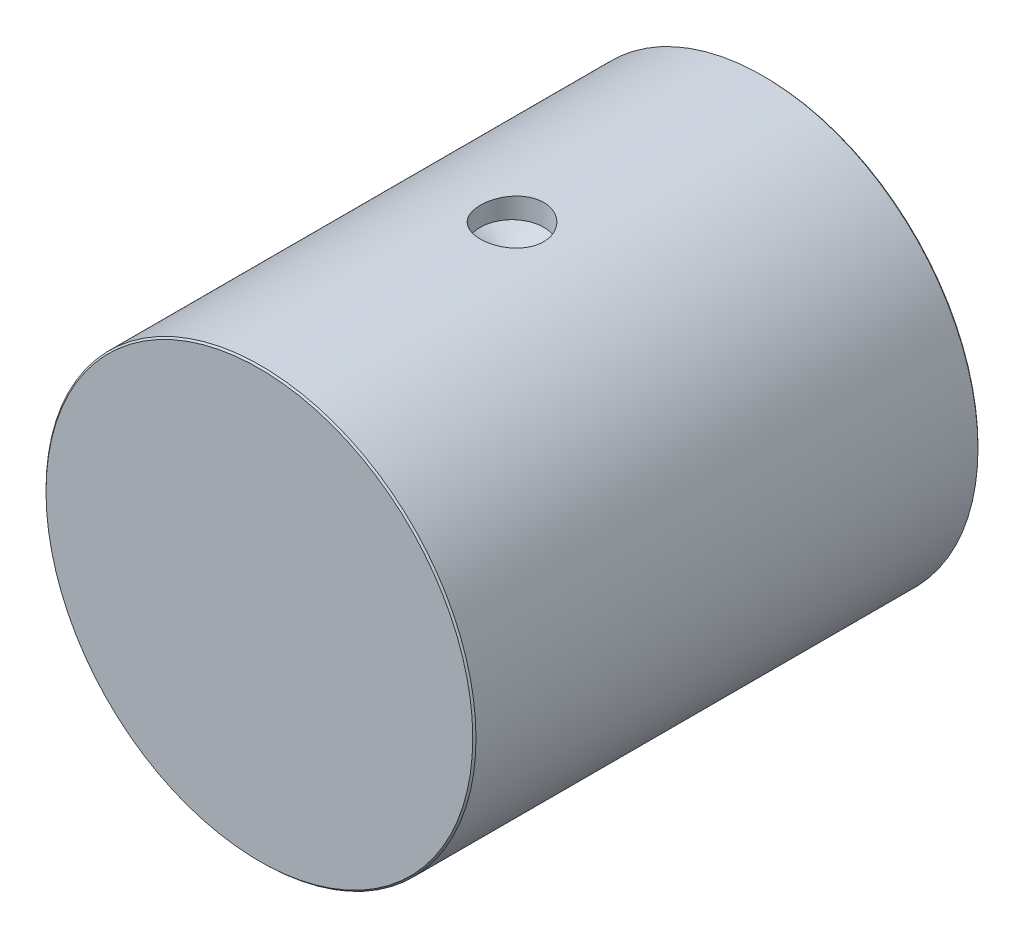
ISO-10303-21;
HEADER;
FILE_DESCRIPTION(('STEP AP214'),'2;1');
FILE_NAME('part.step','',(''),(''),'','','');
FILE_SCHEMA(('AUTOMOTIVE_DESIGN { 1 0 10303 214 1 1 1 1 }'));
ENDSEC;
DATA;
#1=APPLICATION_CONTEXT('core data for automotive mechanical design processes');
#2=APPLICATION_PROTOCOL_DEFINITION('international standard','automotive_design',2000,#1);
#3=PRODUCT_CONTEXT('',#1,'mechanical');
#4=PRODUCT('Part','Part','',(#3));
#5=PRODUCT_RELATED_PRODUCT_CATEGORY('part','',(#4));
#6=PRODUCT_DEFINITION_FORMATION('','',#4);
#7=PRODUCT_DEFINITION_CONTEXT('part definition',#1,'design');
#8=PRODUCT_DEFINITION('design','',#6,#7);
#9=PRODUCT_DEFINITION_SHAPE('','',#8);
#10=(LENGTH_UNIT() NAMED_UNIT(*) SI_UNIT(.MILLI.,.METRE.));
#11=(NAMED_UNIT(*) PLANE_ANGLE_UNIT() SI_UNIT($,.RADIAN.));
#12=(NAMED_UNIT(*) SI_UNIT($,.STERADIAN.) SOLID_ANGLE_UNIT());
#13=UNCERTAINTY_MEASURE_WITH_UNIT(LENGTH_MEASURE(1.E-05),#10,'distance_accuracy_value','');
#14=(GEOMETRIC_REPRESENTATION_CONTEXT(3) GLOBAL_UNCERTAINTY_ASSIGNED_CONTEXT((#13)) GLOBAL_UNIT_ASSIGNED_CONTEXT((#10,
#11,#12)) REPRESENTATION_CONTEXT('',''));
#15=CARTESIAN_POINT('',(0.,0.,0.));
#16=DIRECTION('',(0.,0.,1.));
#17=DIRECTION('',(1.,0.,0.));
#18=AXIS2_PLACEMENT_3D('',#15,#16,#17);
#19=CARTESIAN_POINT('',(0.,0.,-23.5));
#20=DIRECTION('',(0.,0.,1.));
#21=DIRECTION('',(1.,0.,0.));
#22=AXIS2_PLACEMENT_3D('',#19,#20,#21);
#23=CYLINDRICAL_SURFACE('',#22,20.);
#24=CARTESIAN_POINT('',(0.,20.,-2.95));
#25=CARTESIAN_POINT('',(-0.164743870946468,19.999997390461,-2.94999318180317));
#26=CARTESIAN_POINT('',(-0.329584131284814,19.9979431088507,-2.93615314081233));
#27=CARTESIAN_POINT('',(-0.654659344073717,19.9899458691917,-2.88117140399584));
#28=CARTESIAN_POINT('',(-0.814889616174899,19.9839990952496,-2.84000291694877));
#29=CARTESIAN_POINT('',(-1.12599314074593,19.9688853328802,-2.73161930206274));
#30=CARTESIAN_POINT('',(-1.2768732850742,19.9597207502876,-2.66442362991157));
#31=CARTESIAN_POINT('',(-1.56519264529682,19.9391847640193,-2.50594011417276));
#32=CARTESIAN_POINT('',(-1.70263377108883,19.9278136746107,-2.41465570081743));
#33=CARTESIAN_POINT('',(-1.96123689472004,19.9040335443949,-2.20984999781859));
#34=CARTESIAN_POINT('',(-2.08228251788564,19.8916180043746,-2.09618250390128));
#35=CARTESIAN_POINT('',(-2.3036547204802,19.8671993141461,-1.85015181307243));
#36=CARTESIAN_POINT('',(-2.40398012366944,19.8551961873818,-1.71778755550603));
#37=CARTESIAN_POINT('',(-2.58151504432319,19.8328982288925,-1.4373413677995));
#38=CARTESIAN_POINT('',(-2.65861233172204,19.8226117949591,-1.28918766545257));
#39=CARTESIAN_POINT('',(-2.786785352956,19.8050003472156,-0.981857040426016));
#40=CARTESIAN_POINT('',(-2.83786245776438,19.7976751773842,-0.822680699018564));
#41=CARTESIAN_POINT('',(-2.91218459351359,19.7868793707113,-0.499045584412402));
#42=CARTESIAN_POINT('',(-2.93562859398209,19.7833811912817,-0.334633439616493));
#43=CARTESIAN_POINT('',(-2.95463534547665,19.7805517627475,-0.00417435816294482));
#44=CARTESIAN_POINT('',(-2.95019964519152,19.7812202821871,0.161872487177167));
#45=CARTESIAN_POINT('',(-2.91373558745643,19.7866235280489,0.489484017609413));
#46=CARTESIAN_POINT('',(-2.88192856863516,19.7913256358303,0.651073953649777));
#47=CARTESIAN_POINT('',(-2.79197111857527,19.8042153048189,0.966597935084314));
#48=CARTESIAN_POINT('',(-2.73381996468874,19.8124029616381,1.12053177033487));
#49=CARTESIAN_POINT('',(-2.59259390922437,19.8313773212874,1.41704889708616));
#50=CARTESIAN_POINT('',(-2.50942499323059,19.8421737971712,1.55958676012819));
#51=CARTESIAN_POINT('',(-2.3205912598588,19.8651421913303,1.82876726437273));
#52=CARTESIAN_POINT('',(-2.21492501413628,19.8773141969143,1.95540889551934));
#53=CARTESIAN_POINT('',(-1.9828798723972,19.9018063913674,2.19048505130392));
#54=CARTESIAN_POINT('',(-1.85631062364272,19.9141268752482,2.2987317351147));
#55=CARTESIAN_POINT('',(-1.58670179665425,19.9374184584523,2.49247536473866));
#56=CARTESIAN_POINT('',(-1.443662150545,19.9483895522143,2.57797221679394));
#57=CARTESIAN_POINT('',(-1.14501201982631,19.9677571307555,2.72379786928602));
#58=CARTESIAN_POINT('',(-0.989394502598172,19.9761521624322,2.78411247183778));
#59=CARTESIAN_POINT('',(-0.670088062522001,19.9894094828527,2.87769974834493));
#60=CARTESIAN_POINT('',(-0.506399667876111,19.9942720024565,2.91097418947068));
#61=CARTESIAN_POINT('',(-0.177219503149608,19.9998859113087,2.94928750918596));
#62=CARTESIAN_POINT('',(-0.0117584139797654,20.0006749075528,2.95458468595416));
#63=CARTESIAN_POINT('',(0.317689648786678,19.9981551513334,2.93747828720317));
#64=CARTESIAN_POINT('',(0.481676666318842,19.9948465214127,2.91507554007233));
#65=CARTESIAN_POINT('',(0.802741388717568,19.9845265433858,2.84341999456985));
#66=CARTESIAN_POINT('',(0.959847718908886,19.9775325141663,2.79429274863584));
#67=CARTESIAN_POINT('',(1.26359350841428,19.9606235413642,2.67071494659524));
#68=CARTESIAN_POINT('',(1.41023248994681,19.9507084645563,2.59626323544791));
#69=CARTESIAN_POINT('',(1.69001876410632,19.9289661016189,2.42354189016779));
#70=CARTESIAN_POINT('',(1.82306366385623,19.9171258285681,2.32510805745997));
#71=CARTESIAN_POINT('',(2.07083767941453,19.8928921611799,2.10744564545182));
#72=CARTESIAN_POINT('',(2.18556576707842,19.8804987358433,1.98821589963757));
#73=CARTESIAN_POINT('',(2.39438679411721,19.856436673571,1.73119752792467));
#74=CARTESIAN_POINT('',(2.4883067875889,19.8447746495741,1.59326767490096));
#75=CARTESIAN_POINT('',(2.65164425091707,19.8236120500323,1.30343792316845));
#76=CARTESIAN_POINT('',(2.72106236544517,19.814111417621,1.15153839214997));
#77=CARTESIAN_POINT('',(2.83315620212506,19.7983948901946,0.838601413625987));
#78=CARTESIAN_POINT('',(2.87592363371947,19.7921677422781,0.677597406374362));
#79=CARTESIAN_POINT('',(2.9337943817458,19.7836730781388,0.350593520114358));
#80=CARTESIAN_POINT('',(2.94889954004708,19.7814052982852,0.184593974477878));
#81=CARTESIAN_POINT('',(2.95097422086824,19.7810957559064,-0.145965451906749));
#82=CARTESIAN_POINT('',(2.93821564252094,19.7830131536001,-0.310523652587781));
#83=CARTESIAN_POINT('',(2.88550694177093,19.7907692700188,-0.63512705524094));
#84=CARTESIAN_POINT('',(2.84555685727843,19.7966079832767,-0.795172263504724));
#85=CARTESIAN_POINT('',(2.73969416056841,19.811534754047,-1.10613546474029));
#86=CARTESIAN_POINT('',(2.67379992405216,19.8206205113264,-1.25705983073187));
#87=CARTESIAN_POINT('',(2.51794640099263,19.8410205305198,-1.54575484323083));
#88=CARTESIAN_POINT('',(2.42798635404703,19.8523348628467,-1.68352507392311));
#89=CARTESIAN_POINT('',(2.22556464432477,19.876048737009,-1.94338344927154));
#90=CARTESIAN_POINT('',(2.11290144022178,19.8884573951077,-2.06531378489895));
#91=CARTESIAN_POINT('',(1.86869726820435,19.9128851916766,-2.28863519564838));
#92=CARTESIAN_POINT('',(1.73715191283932,19.924904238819,-2.39002148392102));
#93=CARTESIAN_POINT('',(1.4580969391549,19.9472713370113,-2.56985609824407));
#94=CARTESIAN_POINT('',(1.31050621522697,19.9576101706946,-2.64817969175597));
#95=CARTESIAN_POINT('',(1.00418307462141,19.9753613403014,-2.77880967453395));
#96=CARTESIAN_POINT('',(0.845462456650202,19.9827767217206,-2.83114315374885));
#97=CARTESIAN_POINT('',(0.571681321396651,19.9921424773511,-2.89636367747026));
#98=CARTESIAN_POINT('',(0.458315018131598,19.9950740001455,-2.91644676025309));
#99=CARTESIAN_POINT('',(0.229981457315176,19.9990036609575,-2.94326722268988));
#100=CARTESIAN_POINT('',(0.115014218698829,20.0000018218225,-2.95000476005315));
#101=CARTESIAN_POINT('',(0.,20.,-2.95));
#102=B_SPLINE_CURVE_WITH_KNOTS('',3,(#24,#25,#26,#27,#28,#29,#30,#31,#32,#33,#34,#35,#36,#37,
#38,#39,#40,#41,#42,#43,#44,#45,#46,#47,#48,#49,#50,#51,#52,#53,#54,#55,#56,#57,#58,#59,#60,#61,
#62,#63,#64,#65,#66,#67,#68,#69,#70,#71,#72,#73,#74,#75,#76,#77,#78,#79,#80,#81,#82,#83,#84,#85,
#86,#87,#88,#89,#90,#91,#92,#93,#94,#95,#96,#97,#98,#99,#100,#101),.UNSPECIFIED.,.T.,.F.,(4,2,2,
2,2,2,2,2,2,2,2,2,2,2,2,2,2,2,2,2,2,2,2,2,2,2,2,2,2,2,2,2,2,2,2,2,2,2,4),(0.,0.493811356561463,
0.988107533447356,1.4820349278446,1.975892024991,2.47308887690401,2.97031394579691,
3.46990426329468,3.96946825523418,4.4654127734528,4.96132974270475,5.45327375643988,
5.94523126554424,6.43906110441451,6.93292230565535,7.4315576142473,7.93019497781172,
8.42911309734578,8.92799860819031,9.42227003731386,9.91652668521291,10.4084811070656,
10.9004579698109,11.3959028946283,11.8913756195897,12.3908236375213,12.8902585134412,
13.3879651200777,13.8856385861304,14.3784773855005,14.87131549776,15.3638051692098,
15.8563104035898,16.353397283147,16.8505998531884,17.3504440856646,17.849766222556,
18.1945195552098,18.5392688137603),.UNSPECIFIED.);
#103=CARTESIAN_POINT('',(0.,20.,-2.95));
#104=VERTEX_POINT('',#103);
#105=EDGE_CURVE('E11',#104,#104,#102,.T.);
#106=ORIENTED_EDGE('',*,*,#105,.F.);
#107=EDGE_LOOP('',(#106));
#108=FACE_BOUND('',#107,.T.);
#109=CARTESIAN_POINT('',(0.,0.,23.35));
#110=DIRECTION('',(0.,0.,1.));
#111=DIRECTION('',(1.,0.,0.));
#112=AXIS2_PLACEMENT_3D('',#109,#110,#111);
#113=CIRCLE('',#112,20.);
#114=CARTESIAN_POINT('',(20.,0.,23.35));
#115=VERTEX_POINT('',#114);
#116=EDGE_CURVE('E385',#115,#115,#113,.F.);
#117=ORIENTED_EDGE('',*,*,#116,.T.);
#118=EDGE_LOOP('',(#117));
#119=FACE_BOUND('',#118,.T.);
#120=CARTESIAN_POINT('',(0.,0.,-23.35));
#121=DIRECTION('',(0.,0.,1.));
#122=DIRECTION('',(1.,0.,0.));
#123=AXIS2_PLACEMENT_3D('',#120,#121,#122);
#124=CIRCLE('',#123,20.);
#125=CARTESIAN_POINT('',(20.,0.,-23.35));
#126=VERTEX_POINT('',#125);
#127=EDGE_CURVE('E388',#126,#126,#124,.T.);
#128=ORIENTED_EDGE('',*,*,#127,.T.);
#129=EDGE_LOOP('',(#128));
#130=FACE_BOUND('',#129,.T.);
#131=ADVANCED_FACE('F348',(#108,#119,#130),#23,.T.);
#132=CARTESIAN_POINT('',(0.,0.,-23.5));
#133=DIRECTION('',(0.,0.,1.));
#134=DIRECTION('',(1.,0.,0.));
#135=AXIS2_PLACEMENT_3D('',#132,#133,#134);
#136=PLANE('',#135);
#137=CARTESIAN_POINT('',(0.,0.,-23.5));
#138=DIRECTION('',(0.,0.,1.));
#139=DIRECTION('',(1.,0.,0.));
#140=AXIS2_PLACEMENT_3D('',#137,#138,#139);
#141=CIRCLE('',#140,19.85);
#142=CARTESIAN_POINT('',(19.85,0.,-23.5));
#143=VERTEX_POINT('',#142);
#144=EDGE_CURVE('E358',#143,#143,#141,.F.);
#145=ORIENTED_EDGE('',*,*,#144,.T.);
#146=EDGE_LOOP('',(#145));
#147=FACE_BOUND('',#146,.T.);
#148=ADVANCED_FACE('F373',(#147),#136,.F.);
#149=CARTESIAN_POINT('',(0.,0.,23.5));
#150=DIRECTION('',(0.,0.,1.));
#151=DIRECTION('',(1.,0.,0.));
#152=AXIS2_PLACEMENT_3D('',#149,#150,#151);
#153=PLANE('',#152);
#154=CARTESIAN_POINT('',(0.,0.,23.5));
#155=DIRECTION('',(0.,0.,1.));
#156=DIRECTION('',(1.,0.,0.));
#157=AXIS2_PLACEMENT_3D('',#154,#155,#156);
#158=CIRCLE('',#157,19.85);
#159=CARTESIAN_POINT('',(19.85,0.,23.5));
#160=VERTEX_POINT('',#159);
#161=EDGE_CURVE('E390',#160,#160,#158,.T.);
#162=ORIENTED_EDGE('',*,*,#161,.T.);
#163=EDGE_LOOP('',(#162));
#164=FACE_BOUND('',#163,.T.);
#165=ADVANCED_FACE('F378',(#164),#153,.T.);
#166=CARTESIAN_POINT('',(0.,0.,23.5));
#167=DIRECTION('',(0.,0.,-1.));
#168=DIRECTION('',(-1.,0.,0.));
#169=AXIS2_PLACEMENT_3D('',#166,#167,#168);
#170=CONICAL_SURFACE('',#169,19.85,0.78539816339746);
#171=ORIENTED_EDGE('',*,*,#116,.F.);
#172=EDGE_LOOP('',(#171));
#173=FACE_BOUND('',#172,.T.);
#174=ORIENTED_EDGE('',*,*,#161,.F.);
#175=EDGE_LOOP('',(#174));
#176=FACE_BOUND('',#175,.T.);
#177=ADVANCED_FACE('F401',(#173,#176),#170,.T.);
#178=CARTESIAN_POINT('',(0.,0.,-23.35));
#179=DIRECTION('',(0.,0.,1.));
#180=DIRECTION('',(1.,0.,0.));
#181=AXIS2_PLACEMENT_3D('',#178,#179,#180);
#182=CONICAL_SURFACE('',#181,20.,0.785398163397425);
#183=ORIENTED_EDGE('',*,*,#144,.F.);
#184=EDGE_LOOP('',(#183));
#185=FACE_BOUND('',#184,.T.);
#186=ORIENTED_EDGE('',*,*,#127,.F.);
#187=EDGE_LOOP('',(#186));
#188=FACE_BOUND('',#187,.T.);
#189=ADVANCED_FACE('F369',(#185,#188),#182,.T.);
#190=CARTESIAN_POINT('',(0.,-1.79056183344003,0.));
#191=DIRECTION('',(0.,-1.,0.));
#192=DIRECTION('',(0.,0.,-1.));
#193=AXIS2_PLACEMENT_3D('',#190,#191,#192);
#194=CYLINDRICAL_SURFACE('',#193,2.95);
#195=ORIENTED_EDGE('',*,*,#105,.T.);
#196=EDGE_LOOP('',(#195));
#197=FACE_BOUND('',#196,.T.);
#198=CARTESIAN_POINT('',(0.,18.,0.));
#199=DIRECTION('',(0.,-1.,0.));
#200=DIRECTION('',(0.,0.,-1.));
#201=AXIS2_PLACEMENT_3D('',#198,#199,#200);
#202=CIRCLE('',#201,2.95);
#203=CARTESIAN_POINT('',(0.,18.,-2.95));
#204=VERTEX_POINT('',#203);
#205=EDGE_CURVE('E394',#204,#204,#202,.T.);
#206=ORIENTED_EDGE('',*,*,#205,.T.);
#207=EDGE_LOOP('',(#206));
#208=FACE_BOUND('',#207,.T.);
#209=ADVANCED_FACE('F363',(#197,#208),#194,.F.);
#210=CARTESIAN_POINT('',(0.,16.2968167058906,0.));
#211=DIRECTION('',(0.,1.,0.));
#212=DIRECTION('',(0.,0.,1.));
#213=AXIS2_PLACEMENT_3D('',#210,#211,#212);
#214=CONICAL_SURFACE('',#213,0.,1.04719755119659);
#215=ORIENTED_EDGE('',*,*,#205,.F.);
#216=EDGE_LOOP('',(#215));
#217=FACE_BOUND('',#216,.T.);
#218=CARTESIAN_POINT('',(0.,16.2968167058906,0.));
#219=VERTEX_POINT('',#218);
#220=VERTEX_LOOP('',#219);
#221=FACE_BOUND('',#220,.T.);
#222=ADVANCED_FACE('F361',(#217,#221),#214,.F.);
#223=CLOSED_SHELL('',(#131,#148,#165,#177,#189,#209,#222));
#224=MANIFOLD_SOLID_BREP('B2',#223);
#225=ADVANCED_BREP_SHAPE_REPRESENTATION('',(#18,#224),#14);
#226=SHAPE_DEFINITION_REPRESENTATION(#9,#225);
ENDSEC;
END-ISO-10303-21;
